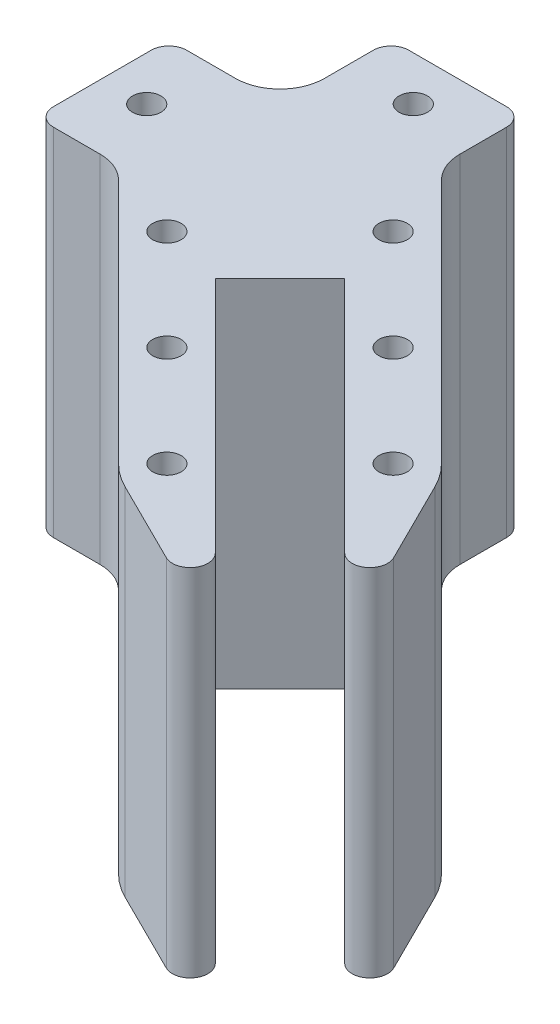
from build123d import *

# Parameters (mm, degrees)
SKETCH_1_R      = 1.6
EXTRUDE_1_DEPTH = 40
FILLET_2_R      = 5
FILLET_3_R      = 2


with BuildPart() as part:
    # Sketch 1 → Extrude 1 (new body)
    with BuildSketch(Plane(origin=(0, 0, 0), x_dir=(1, 0, 0), z_dir=(0, 1, 0))):
        with BuildLine():
            Line((64.631957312, -46.459313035), (35.5, -17.327355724))
            Line((35.5, -17.327355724), (35.5, -8))
            Line((35.5, -8), (20.5, -8))
            Line((20.5, -8), (20.5, -20.5))
            Line((20.5, -20.5), (8, -20.5))
            Line((8, -20.5), (8, -35.5))
            Line((8, -35.5), (17.327355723, -35.5))
            Line((17.327355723, -35.5), (46.459313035, -64.631957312))
            ThreePointArc((46.459313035, -64.631957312), (47.693436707, -65.680688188), (49.080609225, -66.5165411))
            Line((49.080609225, -66.5165411), (58.312025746, -71.104796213))
            ThreePointArc((58.312025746, -71.104796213), (60.82606543, -70.481303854), (60.616403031, -67.899602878))
            Line((60.616403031, -67.899602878), (33.87281233, -41.156012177))
            Line((33.87281233, -41.156012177), (41.156012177, -33.87281233))
            Line((41.156012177, -33.87281233), (67.899602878, -60.616403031))
            ThreePointArc((67.899602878, -60.616403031), (70.481303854, -60.82606543), (71.104796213, -58.312025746))
            Line((71.104796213, -58.312025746), (66.5165411, -49.080609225))
            ThreePointArc((66.5165411, -49.080609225), (65.680688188, -47.693436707), (64.631957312, -46.459313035))
        make_face()
        with Locations(Location((28, -13, 0), (0, 0, 270))):
            Circle(SKETCH_1_R, mode=Mode.SUBTRACT)
        with Locations(Location((13, -28, 0), (0, 0, 270))):
            Circle(SKETCH_1_R, mode=Mode.SUBTRACT)
        with Locations(Location((49.181674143, -61.909596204, 0), (0, 0, 270))):
            Circle(SKETCH_1_R, mode=Mode.SUBTRACT)
        with Locations(Location((37.867965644, -50.595887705, 0), (0, 0, 270))):
            Circle(SKETCH_1_R, mode=Mode.SUBTRACT)
        with Locations(Location((26.554257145, -39.282179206, 0), (0, 0, 270))):
            Circle(SKETCH_1_R, mode=Mode.SUBTRACT)
        with Locations(Location((50.595887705, -37.867965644, 0), (0, 0, 270))):
            Circle(SKETCH_1_R, mode=Mode.SUBTRACT)
        with Locations(Location((39.282179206, -26.554257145, 0), (0, 0, 270))):
            Circle(SKETCH_1_R, mode=Mode.SUBTRACT)
        with Locations(Location((61.909596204, -49.181674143, 0), (0, 0, 270))):
            Circle(SKETCH_1_R, mode=Mode.SUBTRACT)
    extrude(amount=EXTRUDE_1_DEPTH)

    # Fillet 2
    fillet_2_edges = [part.edges().sort_by_distance(p)[0] for p in [
        (17.327355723, 20, 35.5),
        (20.5, 20, 20.5),
        (35.5, 20, 17.327355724),
    ]]
    fillet(fillet_2_edges, radius=FILLET_2_R)

    # Fillet 3
    fillet_3_edges = [part.edges().sort_by_distance(p)[0] for p in [
        (8, 20, 35.5),
        (8, 20, 20.5),
        (20.5, 20, 8),
        (35.5, 20, 8),
    ]]
    fillet(fillet_3_edges, radius=FILLET_3_R)


solid = part.part
